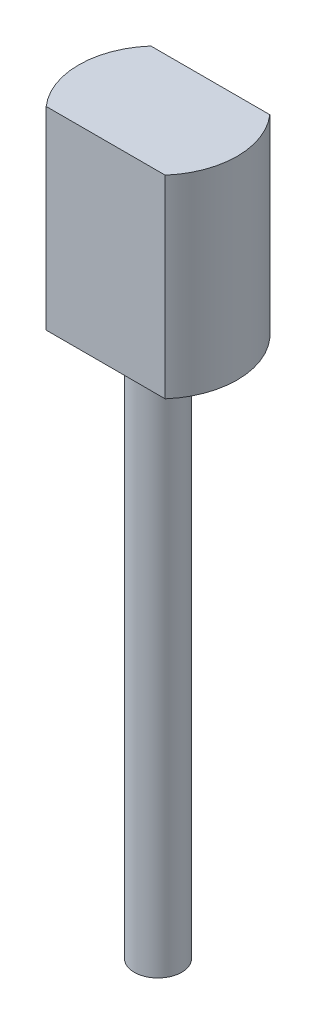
ISO-10303-21;
HEADER;
FILE_DESCRIPTION(('STEP AP214'),'2;1');
FILE_NAME('part.step','',(''),(''),'','','');
FILE_SCHEMA(('AUTOMOTIVE_DESIGN { 1 0 10303 214 1 1 1 1 }'));
ENDSEC;
DATA;
#1=APPLICATION_CONTEXT('core data for automotive mechanical design processes');
#2=APPLICATION_PROTOCOL_DEFINITION('international standard','automotive_design',2000,#1);
#3=PRODUCT_CONTEXT('',#1,'mechanical');
#4=PRODUCT('Part','Part','',(#3));
#5=PRODUCT_RELATED_PRODUCT_CATEGORY('part','',(#4));
#6=PRODUCT_DEFINITION_FORMATION('','',#4);
#7=PRODUCT_DEFINITION_CONTEXT('part definition',#1,'design');
#8=PRODUCT_DEFINITION('design','',#6,#7);
#9=PRODUCT_DEFINITION_SHAPE('','',#8);
#10=(LENGTH_UNIT() NAMED_UNIT(*) SI_UNIT(.MILLI.,.METRE.));
#11=(NAMED_UNIT(*) PLANE_ANGLE_UNIT() SI_UNIT($,.RADIAN.));
#12=(NAMED_UNIT(*) SI_UNIT($,.STERADIAN.) SOLID_ANGLE_UNIT());
#13=UNCERTAINTY_MEASURE_WITH_UNIT(LENGTH_MEASURE(1.E-05),#10,'distance_accuracy_value','');
#14=(GEOMETRIC_REPRESENTATION_CONTEXT(3) GLOBAL_UNCERTAINTY_ASSIGNED_CONTEXT((#13)) GLOBAL_UNIT_ASSIGNED_CONTEXT((#10,
#11,#12)) REPRESENTATION_CONTEXT('',''));
#15=CARTESIAN_POINT('',(0.,0.,0.));
#16=DIRECTION('',(0.,0.,1.));
#17=DIRECTION('',(1.,0.,0.));
#18=AXIS2_PLACEMENT_3D('',#15,#16,#17);
#19=CARTESIAN_POINT('',(0.,0.,0.));
#20=DIRECTION('',(0.,1.,0.));
#21=DIRECTION('',(0.,0.,1.));
#22=AXIS2_PLACEMENT_3D('',#19,#20,#21);
#23=PLANE('',#22);
#24=CARTESIAN_POINT('',(0.,0.,0.));
#25=DIRECTION('',(0.,1.,0.));
#26=DIRECTION('',(0.,0.,1.));
#27=AXIS2_PLACEMENT_3D('',#24,#25,#26);
#28=CIRCLE('',#27,1.0414);
#29=CARTESIAN_POINT('',(0.,0.,1.0414));
#30=VERTEX_POINT('',#29);
#31=EDGE_CURVE('E12',#30,#30,#28,.F.);
#32=ORIENTED_EDGE('',*,*,#31,.F.);
#33=EDGE_LOOP('',(#32));
#34=FACE_BOUND('',#33,.T.);
#35=DIRECTION('',(-1.,0.,0.));
#36=VECTOR('',#35,1.);
#37=CARTESIAN_POINT('',(-2.61246748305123,0.,2.2987));
#38=LINE('',#37,#36);
#39=CARTESIAN_POINT('',(2.61246748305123,0.,2.2987));
#40=VERTEX_POINT('',#39);
#41=CARTESIAN_POINT('',(-2.61246748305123,0.,2.2987));
#42=VERTEX_POINT('',#41);
#43=EDGE_CURVE('E105',#40,#42,#38,.T.);
#44=ORIENTED_EDGE('',*,*,#43,.T.);
#45=CARTESIAN_POINT('',(0.,0.,0.));
#46=DIRECTION('',(0.,1.,0.));
#47=DIRECTION('',(0.,0.,1.));
#48=AXIS2_PLACEMENT_3D('',#45,#46,#47);
#49=CIRCLE('',#48,3.4798);
#50=CARTESIAN_POINT('',(-2.61246748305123,0.,-2.2987));
#51=VERTEX_POINT('',#50);
#52=EDGE_CURVE('E96',#51,#42,#49,.T.);
#53=ORIENTED_EDGE('',*,*,#52,.F.);
#54=DIRECTION('',(1.,0.,0.));
#55=VECTOR('',#54,1.);
#56=CARTESIAN_POINT('',(-2.61246748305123,0.,-2.2987));
#57=LINE('',#56,#55);
#58=CARTESIAN_POINT('',(2.61246748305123,0.,-2.2987));
#59=VERTEX_POINT('',#58);
#60=EDGE_CURVE('E102',#51,#59,#57,.T.);
#61=ORIENTED_EDGE('',*,*,#60,.T.);
#62=EDGE_CURVE('E88',#40,#59,#49,.T.);
#63=ORIENTED_EDGE('',*,*,#62,.F.);
#64=EDGE_LOOP('',(#44,#53,#61,#63));
#65=FACE_BOUND('',#64,.T.);
#66=ADVANCED_FACE('F33',(#34,#65),#23,.F.);
#67=CARTESIAN_POINT('',(0.,8.509,0.));
#68=DIRECTION('',(0.,-1.,0.));
#69=DIRECTION('',(0.,0.,-1.));
#70=AXIS2_PLACEMENT_3D('',#67,#68,#69);
#71=CYLINDRICAL_SURFACE('',#70,3.4798);
#72=DIRECTION('',(0.,1.,0.));
#73=VECTOR('',#72,1.);
#74=CARTESIAN_POINT('',(-2.61246748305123,-11.5763717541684,2.2987));
#75=LINE('',#74,#73);
#76=CARTESIAN_POINT('',(-2.61246748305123,8.509,2.2987));
#77=VERTEX_POINT('',#76);
#78=EDGE_CURVE('E80',#42,#77,#75,.T.);
#79=ORIENTED_EDGE('',*,*,#78,.T.);
#80=CARTESIAN_POINT('',(0.,8.509,0.));
#81=DIRECTION('',(0.,1.,0.));
#82=DIRECTION('',(0.,0.,1.));
#83=AXIS2_PLACEMENT_3D('',#80,#81,#82);
#84=CIRCLE('',#83,3.4798);
#85=CARTESIAN_POINT('',(-2.61246748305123,8.509,-2.2987));
#86=VERTEX_POINT('',#85);
#87=EDGE_CURVE('E91',#86,#77,#84,.T.);
#88=ORIENTED_EDGE('',*,*,#87,.F.);
#89=DIRECTION('',(0.,1.,0.));
#90=VECTOR('',#89,1.);
#91=CARTESIAN_POINT('',(-2.61246748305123,-11.5763717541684,-2.2987));
#92=LINE('',#91,#90);
#93=EDGE_CURVE('E48',#51,#86,#92,.T.);
#94=ORIENTED_EDGE('',*,*,#93,.F.);
#95=ORIENTED_EDGE('',*,*,#52,.T.);
#96=EDGE_LOOP('',(#79,#88,#94,#95));
#97=FACE_BOUND('',#96,.T.);
#98=ADVANCED_FACE('F35',(#97),#71,.T.);
#99=DIRECTION('',(0.,1.,0.));
#100=VECTOR('',#99,1.);
#101=CARTESIAN_POINT('',(2.61246748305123,-11.5763717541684,2.2987));
#102=LINE('',#101,#100);
#103=CARTESIAN_POINT('',(2.61246748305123,8.509,2.2987));
#104=VERTEX_POINT('',#103);
#105=EDGE_CURVE('E56',#40,#104,#102,.T.);
#106=ORIENTED_EDGE('',*,*,#105,.F.);
#107=ORIENTED_EDGE('',*,*,#62,.T.);
#108=DIRECTION('',(0.,1.,0.));
#109=VECTOR('',#108,1.);
#110=CARTESIAN_POINT('',(2.61246748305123,-11.5763717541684,-2.2987));
#111=LINE('',#110,#109);
#112=CARTESIAN_POINT('',(2.61246748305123,8.509,-2.2987));
#113=VERTEX_POINT('',#112);
#114=EDGE_CURVE('E74',#59,#113,#111,.T.);
#115=ORIENTED_EDGE('',*,*,#114,.T.);
#116=EDGE_CURVE('E41',#104,#113,#84,.T.);
#117=ORIENTED_EDGE('',*,*,#116,.F.);
#118=EDGE_LOOP('',(#106,#107,#115,#117));
#119=FACE_BOUND('',#118,.T.);
#120=ADVANCED_FACE('F86',(#119),#71,.T.);
#121=CARTESIAN_POINT('',(0.,8.509,0.));
#122=DIRECTION('',(0.,1.,0.));
#123=DIRECTION('',(0.,0.,1.));
#124=AXIS2_PLACEMENT_3D('',#121,#122,#123);
#125=PLANE('',#124);
#126=ORIENTED_EDGE('',*,*,#87,.T.);
#127=DIRECTION('',(1.,0.,0.));
#128=VECTOR('',#127,1.);
#129=CARTESIAN_POINT('',(-2.61246748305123,8.509,2.2987));
#130=LINE('',#129,#128);
#131=EDGE_CURVE('E81',#77,#104,#130,.T.);
#132=ORIENTED_EDGE('',*,*,#131,.T.);
#133=ORIENTED_EDGE('',*,*,#116,.T.);
#134=DIRECTION('',(-1.,0.,0.));
#135=VECTOR('',#134,1.);
#136=CARTESIAN_POINT('',(-2.61246748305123,8.509,-2.2987));
#137=LINE('',#136,#135);
#138=EDGE_CURVE('E71',#113,#86,#137,.T.);
#139=ORIENTED_EDGE('',*,*,#138,.T.);
#140=EDGE_LOOP('',(#126,#132,#133,#139));
#141=FACE_BOUND('',#140,.T.);
#142=ADVANCED_FACE('F90',(#141),#125,.T.);
#143=CARTESIAN_POINT('',(0.,-23.749,0.));
#144=DIRECTION('',(0.,1.,0.));
#145=DIRECTION('',(0.,0.,1.));
#146=AXIS2_PLACEMENT_3D('',#143,#144,#145);
#147=CYLINDRICAL_SURFACE('',#146,1.0414);
#148=CARTESIAN_POINT('',(0.,-23.749,0.));
#149=DIRECTION('',(0.,-1.,0.));
#150=DIRECTION('',(0.,0.,-1.));
#151=AXIS2_PLACEMENT_3D('',#148,#149,#150);
#152=CIRCLE('',#151,1.0414);
#153=CARTESIAN_POINT('',(0.,-23.749,1.0414));
#154=VERTEX_POINT('',#153);
#155=EDGE_CURVE('E94',#154,#154,#152,.T.);
#156=CARTESIAN_POINT('',(0.,-23.749,1.0414));
#157=CARTESIAN_POINT('',(0.,-23.5016145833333,1.0414));
#158=CARTESIAN_POINT('',(0.,-23.2542291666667,1.0414));
#159=CARTESIAN_POINT('',(0.,-22.7594583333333,1.0414));
#160=CARTESIAN_POINT('',(0.,-22.5120729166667,1.0414));
#161=CARTESIAN_POINT('',(0.,-22.0173020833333,1.0414));
#162=CARTESIAN_POINT('',(0.,-21.7699166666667,1.0414));
#163=CARTESIAN_POINT('',(0.,-21.2751458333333,1.0414));
#164=CARTESIAN_POINT('',(0.,-21.0277604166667,1.0414));
#165=CARTESIAN_POINT('',(0.,-20.5329895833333,1.0414));
#166=CARTESIAN_POINT('',(0.,-20.2856041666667,1.0414));
#167=CARTESIAN_POINT('',(0.,-19.7908333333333,1.0414));
#168=CARTESIAN_POINT('',(0.,-19.5434479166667,1.0414));
#169=CARTESIAN_POINT('',(0.,-19.0486770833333,1.0414));
#170=CARTESIAN_POINT('',(0.,-18.8012916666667,1.0414));
#171=CARTESIAN_POINT('',(0.,-18.3065208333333,1.0414));
#172=CARTESIAN_POINT('',(0.,-18.0591354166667,1.0414));
#173=CARTESIAN_POINT('',(0.,-17.5643645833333,1.0414));
#174=CARTESIAN_POINT('',(0.,-17.3169791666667,1.0414));
#175=CARTESIAN_POINT('',(0.,-16.8222083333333,1.0414));
#176=CARTESIAN_POINT('',(0.,-16.5748229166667,1.0414));
#177=CARTESIAN_POINT('',(0.,-16.0800520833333,1.0414));
#178=CARTESIAN_POINT('',(0.,-15.8326666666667,1.0414));
#179=CARTESIAN_POINT('',(0.,-15.3378958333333,1.0414));
#180=CARTESIAN_POINT('',(0.,-15.0905104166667,1.0414));
#181=CARTESIAN_POINT('',(0.,-14.5957395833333,1.0414));
#182=CARTESIAN_POINT('',(0.,-14.3483541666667,1.0414));
#183=CARTESIAN_POINT('',(0.,-13.8535833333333,1.0414));
#184=CARTESIAN_POINT('',(0.,-13.6061979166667,1.0414));
#185=CARTESIAN_POINT('',(0.,-13.1114270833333,1.0414));
#186=CARTESIAN_POINT('',(0.,-12.8640416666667,1.0414));
#187=CARTESIAN_POINT('',(0.,-12.3692708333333,1.0414));
#188=CARTESIAN_POINT('',(0.,-12.1218854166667,1.0414));
#189=CARTESIAN_POINT('',(0.,-11.6271145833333,1.0414));
#190=CARTESIAN_POINT('',(0.,-11.3797291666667,1.0414));
#191=CARTESIAN_POINT('',(0.,-10.8849583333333,1.0414));
#192=CARTESIAN_POINT('',(0.,-10.6375729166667,1.0414));
#193=CARTESIAN_POINT('',(0.,-10.1428020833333,1.0414));
#194=CARTESIAN_POINT('',(0.,-9.89541666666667,1.0414));
#195=CARTESIAN_POINT('',(0.,-9.40064583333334,1.0414));
#196=CARTESIAN_POINT('',(0.,-9.15326041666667,1.0414));
#197=CARTESIAN_POINT('',(0.,-8.65848958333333,1.0414));
#198=CARTESIAN_POINT('',(0.,-8.41110416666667,1.0414));
#199=CARTESIAN_POINT('',(0.,-7.91633333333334,1.0414));
#200=CARTESIAN_POINT('',(0.,-7.66894791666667,1.0414));
#201=CARTESIAN_POINT('',(0.,-7.17417708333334,1.0414));
#202=CARTESIAN_POINT('',(0.,-6.92679166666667,1.0414));
#203=CARTESIAN_POINT('',(0.,-6.43202083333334,1.0414));
#204=CARTESIAN_POINT('',(0.,-6.18463541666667,1.0414));
#205=CARTESIAN_POINT('',(0.,-5.68986458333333,1.0414));
#206=CARTESIAN_POINT('',(0.,-5.44247916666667,1.0414));
#207=CARTESIAN_POINT('',(0.,-4.94770833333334,1.0414));
#208=CARTESIAN_POINT('',(0.,-4.70032291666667,1.0414));
#209=CARTESIAN_POINT('',(0.,-4.20555208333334,1.0414));
#210=CARTESIAN_POINT('',(0.,-3.95816666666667,1.0414));
#211=CARTESIAN_POINT('',(0.,-3.46339583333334,1.0414));
#212=CARTESIAN_POINT('',(0.,-3.21601041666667,1.0414));
#213=CARTESIAN_POINT('',(0.,-2.72123958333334,1.0414));
#214=CARTESIAN_POINT('',(0.,-2.47385416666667,1.0414));
#215=CARTESIAN_POINT('',(0.,-1.97908333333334,1.0414));
#216=CARTESIAN_POINT('',(0.,-1.73169791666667,1.0414));
#217=CARTESIAN_POINT('',(0.,-1.23692708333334,1.0414));
#218=CARTESIAN_POINT('',(0.,-0.989541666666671,1.0414));
#219=CARTESIAN_POINT('',(0.,-0.494770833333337,1.0414));
#220=CARTESIAN_POINT('',(0.,-0.24738541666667,1.0414));
#221=CARTESIAN_POINT('',(0.,0.,1.0414));
#222=B_SPLINE_CURVE_WITH_KNOTS('',3,(#156,#157,#158,#159,#160,#161,#162,#163,#164,#165,#166,
#167,#168,#169,#170,#171,#172,#173,#174,#175,#176,#177,#178,#179,#180,#181,#182,#183,#184,#185,
#186,#187,#188,#189,#190,#191,#192,#193,#194,#195,#196,#197,#198,#199,#200,#201,#202,#203,#204,
#205,#206,#207,#208,#209,#210,#211,#212,#213,#214,#215,#216,#217,#218,#219,#220,#221),
.UNSPECIFIED.,.F.,.F.,(4,2,2,2,2,2,2,2,2,2,2,2,2,2,2,2,2,2,2,2,2,2,2,2,2,2,2,2,2,2,2,2,4),(0.,
0.742156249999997,1.4843125,2.22646875,2.968625,3.71078125,4.4529375,5.19509375,
5.93724999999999,6.67940625,7.4215625,8.16371874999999,8.90587499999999,9.64803124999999,
10.3901875,11.13234375,11.8745,12.61665625,13.3588125,14.10096875,14.843125,15.58528125,
16.3274375,17.06959375,17.81175,18.55390625,19.2960625,20.03821875,20.780375,21.52253125,
22.2646875,23.00684375,23.749),.UNSPECIFIED.);
#223=EDGE_CURVE('BSEAM123',#154,#30,#222,.T.);
#224=ORIENTED_EDGE('',*,*,#155,.F.);
#225=ORIENTED_EDGE('',*,*,#31,.T.);
#226=ORIENTED_EDGE('',*,*,#223,.T.);
#227=ORIENTED_EDGE('',*,*,#223,.F.);
#228=EDGE_LOOP('',(#224,#226,#225,#227));
#229=FACE_BOUND('',#228,.T.);
#230=ADVANCED_FACE('F123',(#229),#147,.T.);
#231=CARTESIAN_POINT('',(0.,-23.749,0.));
#232=DIRECTION('',(0.,-1.,0.));
#233=DIRECTION('',(0.,0.,-1.));
#234=AXIS2_PLACEMENT_3D('',#231,#232,#233);
#235=PLANE('',#234);
#236=ORIENTED_EDGE('',*,*,#155,.T.);
#237=EDGE_LOOP('',(#236));
#238=FACE_BOUND('',#237,.T.);
#239=ADVANCED_FACE('F126',(#238),#235,.T.);
#240=CARTESIAN_POINT('',(-2.61246748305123,-11.5763717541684,-2.2987));
#241=DIRECTION('',(0.,0.,-1.));
#242=DIRECTION('',(-1.,0.,0.));
#243=AXIS2_PLACEMENT_3D('',#240,#241,#242);
#244=PLANE('',#243);
#245=ORIENTED_EDGE('',*,*,#93,.T.);
#246=ORIENTED_EDGE('',*,*,#138,.F.);
#247=ORIENTED_EDGE('',*,*,#114,.F.);
#248=ORIENTED_EDGE('',*,*,#60,.F.);
#249=EDGE_LOOP('',(#245,#246,#247,#248));
#250=FACE_BOUND('',#249,.T.);
#251=ADVANCED_FACE('F73',(#250),#244,.T.);
#252=CARTESIAN_POINT('',(-2.61246748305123,-11.5763717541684,2.2987));
#253=DIRECTION('',(0.,0.,1.));
#254=DIRECTION('',(1.,0.,0.));
#255=AXIS2_PLACEMENT_3D('',#252,#253,#254);
#256=PLANE('',#255);
#257=ORIENTED_EDGE('',*,*,#105,.T.);
#258=ORIENTED_EDGE('',*,*,#131,.F.);
#259=ORIENTED_EDGE('',*,*,#78,.F.);
#260=ORIENTED_EDGE('',*,*,#43,.F.);
#261=EDGE_LOOP('',(#257,#258,#259,#260));
#262=FACE_BOUND('',#261,.T.);
#263=ADVANCED_FACE('F113',(#262),#256,.T.);
#264=CLOSED_SHELL('',(#66,#98,#120,#142,#230,#239,#251,#263));
#265=MANIFOLD_SOLID_BREP('B2',#264);
#266=ADVANCED_BREP_SHAPE_REPRESENTATION('',(#18,#265),#14);
#267=SHAPE_DEFINITION_REPRESENTATION(#9,#266);
ENDSEC;
END-ISO-10303-21;
